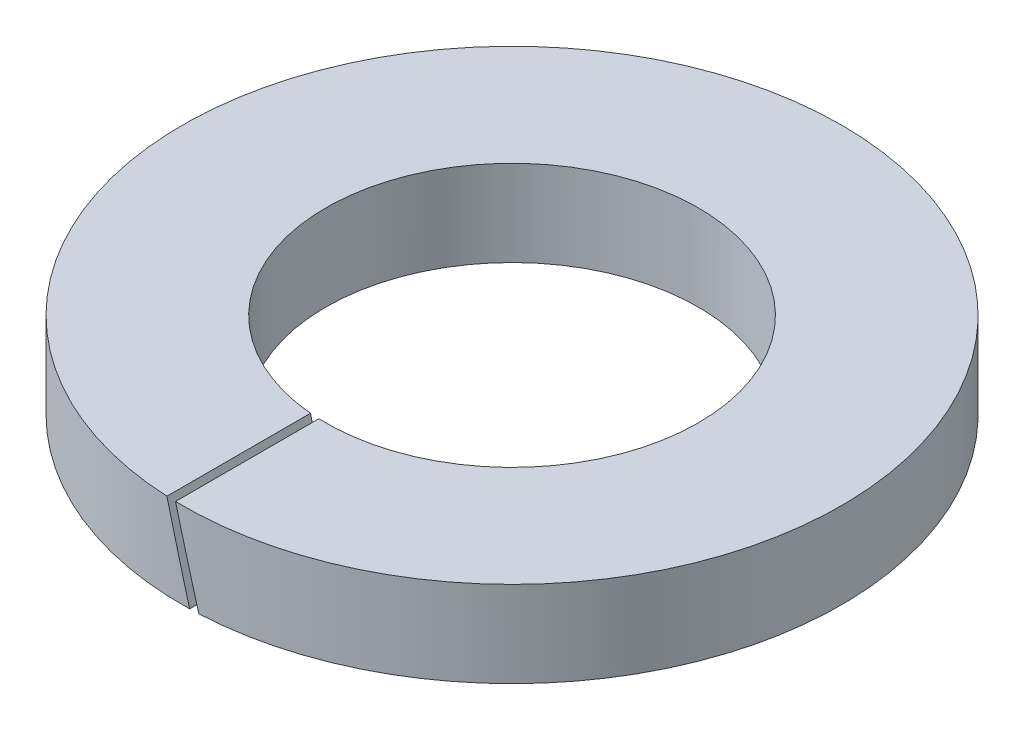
from build123d import *

# Parameters (mm, degrees)
ESQUISSE1_W      = 5
ESQUISSE1_H      = 3
FENTE_REACH      = 27.889
FENTE_END_RADIUS = 6.5


with BuildPart() as part:
    # Esquisse1 → Base (revolve)
    with BuildSketch(Plane.XY, mode=Mode.PRIVATE) as base_sk:
        with Locations((9, 1.5)):
            Rectangle(ESQUISSE1_W, ESQUISSE1_H)
    revolve(base_sk.sketch.rotate(Axis((0, 0.5, 0), (0, -1, 0)), 90), axis=Axis((0, 0.5, 0), (0, -1, 0)))

    # Fente: up to this cylinder (the profile starts outside it)
    fente_end = Plane(origin=(0, 1.5, 0), z_dir=(0, 1, 0)) * Cylinder(FENTE_END_RADIUS, 69.778, mode=Mode.PRIVATE)
    # Esquisse2 → Fente (cut, up to the surface)
    with BuildSketch(Plane.XY.offset(11.5), mode=Mode.PRIVATE) as fente_sk1:
        Polygon((-0.948736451, 4.461177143), (-0.144888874, 1.461177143), (0.658958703, -1.538822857), (0.948736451, -1.461177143), (0.144888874, 1.538822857), (-0.658958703, 4.538822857), align=None)
    fente_tool1 = extrude(fente_sk1.sketch, amount=-FENTE_REACH, mode=Mode.PRIVATE) - fente_end
    add(fente_tool1.solids().sort_by_distance((0, 1.5, 11.5))[0], mode=Mode.SUBTRACT)


solid = part.part
